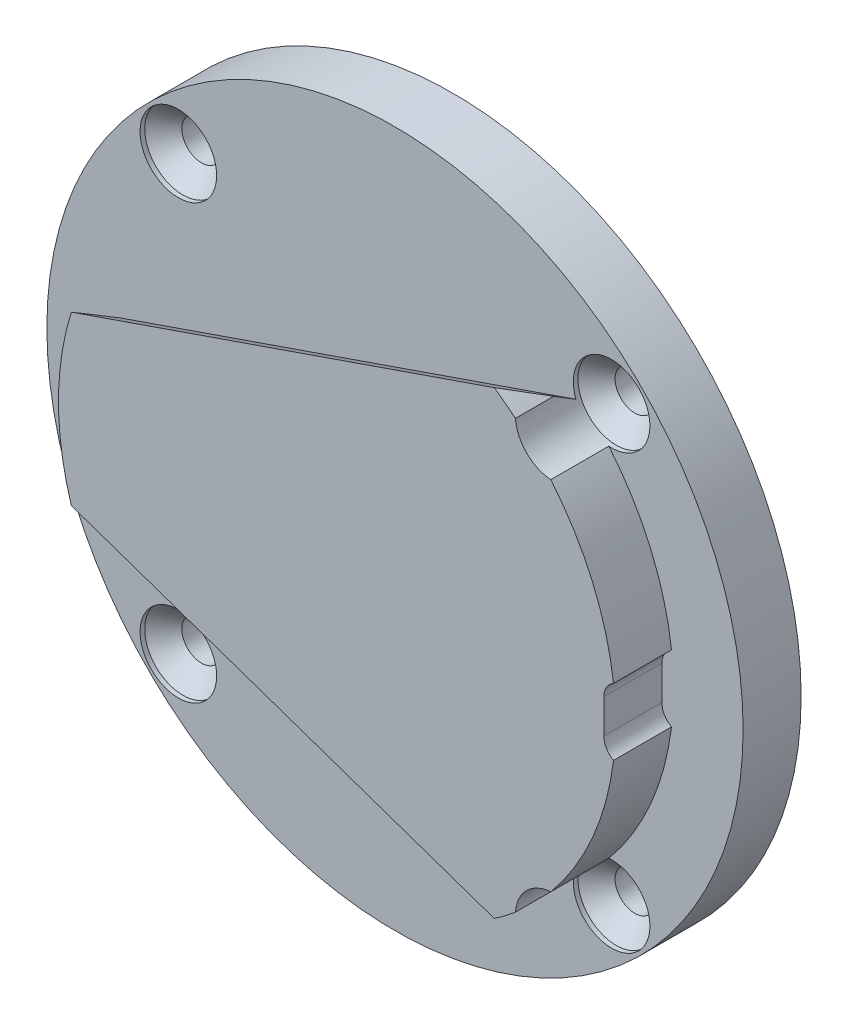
ISO-10303-21;
HEADER;
FILE_DESCRIPTION(('STEP AP214'),'2;1');
FILE_NAME('part.step','',(''),(''),'','','');
FILE_SCHEMA(('AUTOMOTIVE_DESIGN { 1 0 10303 214 1 1 1 1 }'));
ENDSEC;
DATA;
#1=APPLICATION_CONTEXT('core data for automotive mechanical design processes');
#2=APPLICATION_PROTOCOL_DEFINITION('international standard','automotive_design',2000,#1);
#3=PRODUCT_CONTEXT('',#1,'mechanical');
#4=PRODUCT('Part','Part','',(#3));
#5=PRODUCT_RELATED_PRODUCT_CATEGORY('part','',(#4));
#6=PRODUCT_DEFINITION_FORMATION('','',#4);
#7=PRODUCT_DEFINITION_CONTEXT('part definition',#1,'design');
#8=PRODUCT_DEFINITION('design','',#6,#7);
#9=PRODUCT_DEFINITION_SHAPE('','',#8);
#10=(LENGTH_UNIT() NAMED_UNIT(*) SI_UNIT(.MILLI.,.METRE.));
#11=(NAMED_UNIT(*) PLANE_ANGLE_UNIT() SI_UNIT($,.RADIAN.));
#12=(NAMED_UNIT(*) SI_UNIT($,.STERADIAN.) SOLID_ANGLE_UNIT());
#13=UNCERTAINTY_MEASURE_WITH_UNIT(LENGTH_MEASURE(1.E-05),#10,'distance_accuracy_value','');
#14=(GEOMETRIC_REPRESENTATION_CONTEXT(3) GLOBAL_UNCERTAINTY_ASSIGNED_CONTEXT((#13)) GLOBAL_UNIT_ASSIGNED_CONTEXT((#10,
#11,#12)) REPRESENTATION_CONTEXT('',''));
#15=CARTESIAN_POINT('',(0.,0.,0.));
#16=DIRECTION('',(0.,0.,1.));
#17=DIRECTION('',(1.,0.,0.));
#18=AXIS2_PLACEMENT_3D('',#15,#16,#17);
#19=CARTESIAN_POINT('',(0.,0.,12.5));
#20=DIRECTION('',(0.,0.,1.));
#21=DIRECTION('',(-1.,0.,0.));
#22=AXIS2_PLACEMENT_3D('',#19,#20,#21);
#23=CYLINDRICAL_SURFACE('',#22,60.);
#24=CARTESIAN_POINT('',(0.,0.,25.));
#25=DIRECTION('',(0.,0.,1.));
#26=DIRECTION('',(-1.,0.,0.));
#27=AXIS2_PLACEMENT_3D('',#24,#25,#26);
#28=CIRCLE('',#27,60.);
#29=CARTESIAN_POINT('',(59.5692450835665,-7.17670120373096,25.));
#30=VERTEX_POINT('',#29);
#31=CARTESIAN_POINT('',(46.0683596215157,-38.4409448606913,25.));
#32=VERTEX_POINT('',#31);
#33=EDGE_CURVE('E108',#30,#32,#28,.F.);
#34=ORIENTED_EDGE('',*,*,#33,.T.);
#35=DIRECTION('',(0.,0.,-1.));
#36=VECTOR('',#35,1.);
#37=CARTESIAN_POINT('',(46.0683596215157,-38.4409448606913,18.25));
#38=LINE('',#37,#36);
#39=CARTESIAN_POINT('',(46.0683596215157,-38.4409448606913,12.5));
#40=VERTEX_POINT('',#39);
#41=EDGE_CURVE('E9',#32,#40,#38,.T.);
#42=ORIENTED_EDGE('',*,*,#41,.T.);
#43=CARTESIAN_POINT('',(0.,0.,12.5));
#44=DIRECTION('',(0.,0.,1.));
#45=DIRECTION('',(-1.,0.,0.));
#46=AXIS2_PLACEMENT_3D('',#43,#44,#45);
#47=CIRCLE('',#46,60.);
#48=CARTESIAN_POINT('',(59.5692450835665,-7.17670120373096,12.5));
#49=VERTEX_POINT('',#48);
#50=EDGE_CURVE('E196',#40,#49,#47,.T.);
#51=ORIENTED_EDGE('',*,*,#50,.T.);
#52=DIRECTION('',(0.,0.,1.));
#53=VECTOR('',#52,1.);
#54=CARTESIAN_POINT('',(59.5692450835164,-7.17670120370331,-201.753354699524));
#55=LINE('',#54,#53);
#56=EDGE_CURVE('E116',#49,#30,#55,.T.);
#57=ORIENTED_EDGE('',*,*,#56,.T.);
#58=EDGE_LOOP('',(#34,#42,#51,#57));
#59=FACE_BOUND('',#58,.T.);
#60=ADVANCED_FACE('F14',(#59),#23,.T.);
#61=CARTESIAN_POINT('',(0.,0.,-36.9102057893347));
#62=DIRECTION('',(-0.282702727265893,-0.818583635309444,-0.5));
#63=DIRECTION('',(-0.163218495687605,-0.472609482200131,0.866025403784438));
#64=AXIS2_PLACEMENT_3D('',#61,#62,#63);
#65=ELLIPSE('',#64,120.,60.);
#66=CARTESIAN_POINT('',(33.8829537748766,-49.51712273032,25.));
#67=VERTEX_POINT('',#66);
#68=CARTESIAN_POINT('',(38.4409448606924,-46.0683596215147,16.7766848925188));
#69=VERTEX_POINT('',#68);
#70=EDGE_CURVE('E118',#67,#69,#65,.F.);
#71=ORIENTED_EDGE('',*,*,#70,.T.);
#72=DIRECTION('',(0.,0.,-1.));
#73=VECTOR('',#72,1.);
#74=CARTESIAN_POINT('',(38.4409448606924,-46.0683596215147,18.25));
#75=LINE('',#74,#73);
#76=CARTESIAN_POINT('',(38.4409448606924,-46.0683596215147,25.));
#77=VERTEX_POINT('',#76);
#78=EDGE_CURVE('E22',#69,#77,#75,.F.);
#79=ORIENTED_EDGE('',*,*,#78,.T.);
#80=EDGE_CURVE('E111',#77,#67,#28,.F.);
#81=ORIENTED_EDGE('',*,*,#80,.T.);
#82=EDGE_LOOP('',(#71,#79,#81));
#83=FACE_BOUND('',#82,.T.);
#84=ADVANCED_FACE('F141',(#83),#23,.T.);
#85=CARTESIAN_POINT('',(0.,0.,12.5));
#86=DIRECTION('',(0.,0.,1.));
#87=DIRECTION('',(-1.,0.,0.));
#88=AXIS2_PLACEMENT_3D('',#85,#86,#87);
#89=CYLINDRICAL_SURFACE('',#88,60.);
#90=CARTESIAN_POINT('',(0.,0.,25.));
#91=DIRECTION('',(0.,0.,1.));
#92=DIRECTION('',(-1.,0.,0.));
#93=AXIS2_PLACEMENT_3D('',#90,#91,#92);
#94=CIRCLE('',#93,60.);
#95=CARTESIAN_POINT('',(33.8829537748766,49.51712273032,25.));
#96=VERTEX_POINT('',#95);
#97=CARTESIAN_POINT('',(38.4409448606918,46.0683596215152,25.));
#98=VERTEX_POINT('',#97);
#99=EDGE_CURVE('E205',#96,#98,#94,.F.);
#100=ORIENTED_EDGE('',*,*,#99,.T.);
#101=DIRECTION('',(0.,0.,-1.));
#102=VECTOR('',#101,1.);
#103=CARTESIAN_POINT('',(38.4409448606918,46.0683596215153,18.25));
#104=LINE('',#103,#102);
#105=CARTESIAN_POINT('',(38.4409448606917,46.0683596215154,16.7766848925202));
#106=VERTEX_POINT('',#105);
#107=EDGE_CURVE('E180',#98,#106,#104,.T.);
#108=ORIENTED_EDGE('',*,*,#107,.T.);
#109=CARTESIAN_POINT('',(0.,0.,-36.9102057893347));
#110=DIRECTION('',(-0.282702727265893,0.818583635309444,-0.5));
#111=DIRECTION('',(-0.163218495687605,0.472609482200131,0.866025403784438));
#112=AXIS2_PLACEMENT_3D('',#109,#110,#111);
#113=ELLIPSE('',#112,120.,60.);
#114=EDGE_CURVE('E201',#96,#106,#113,.T.);
#115=ORIENTED_EDGE('',*,*,#114,.F.);
#116=EDGE_LOOP('',(#100,#108,#115));
#117=FACE_BOUND('',#116,.T.);
#118=ADVANCED_FACE('F272',(#117),#89,.T.);
#119=CARTESIAN_POINT('',(0.,0.,12.5));
#120=DIRECTION('',(0.,0.,1.));
#121=DIRECTION('',(-1.,0.,0.));
#122=AXIS2_PLACEMENT_3D('',#119,#120,#121);
#123=CIRCLE('',#122,60.);
#124=CARTESIAN_POINT('',(59.5692450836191,7.17670120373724,12.5));
#125=VERTEX_POINT('',#124);
#126=CARTESIAN_POINT('',(46.0683596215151,38.4409448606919,12.5));
#127=VERTEX_POINT('',#126);
#128=EDGE_CURVE('E190',#125,#127,#123,.T.);
#129=ORIENTED_EDGE('',*,*,#128,.T.);
#130=DIRECTION('',(0.,0.,-1.));
#131=VECTOR('',#130,1.);
#132=CARTESIAN_POINT('',(46.0683596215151,38.4409448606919,18.25));
#133=LINE('',#132,#131);
#134=CARTESIAN_POINT('',(46.0683596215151,38.4409448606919,25.));
#135=VERTEX_POINT('',#134);
#136=EDGE_CURVE('E184',#127,#135,#133,.F.);
#137=ORIENTED_EDGE('',*,*,#136,.T.);
#138=CARTESIAN_POINT('',(59.5692450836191,7.17670120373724,25.));
#139=VERTEX_POINT('',#138);
#140=EDGE_CURVE('E239',#135,#139,#94,.F.);
#141=ORIENTED_EDGE('',*,*,#140,.T.);
#142=DIRECTION('',(0.,0.,1.));
#143=VECTOR('',#142,1.);
#144=CARTESIAN_POINT('',(59.5692450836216,7.17670120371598,12.5));
#145=LINE('',#144,#143);
#146=EDGE_CURVE('E202',#139,#125,#145,.F.);
#147=ORIENTED_EDGE('',*,*,#146,.T.);
#148=EDGE_LOOP('',(#129,#137,#141,#147));
#149=FACE_BOUND('',#148,.T.);
#150=ADVANCED_FACE('F256',(#149),#89,.T.);
#151=CARTESIAN_POINT('',(0.,0.,12.5));
#152=DIRECTION('',(0.,0.,-1.));
#153=DIRECTION('',(1.,0.,0.));
#154=AXIS2_PLACEMENT_3D('',#151,#152,#153);
#155=PLANE('',#154);
#156=CARTESIAN_POINT('',(46.6690475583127,-46.6690475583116,12.5));
#157=DIRECTION('',(0.,0.,-1.));
#158=DIRECTION('',(-1.,0.,0.));
#159=AXIS2_PLACEMENT_3D('',#156,#157,#158);
#160=CIRCLE('',#159,8.25);
#161=CARTESIAN_POINT('',(38.9926202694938,-43.6466372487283,12.5));
#162=VERTEX_POINT('',#161);
#163=EDGE_CURVE('E102',#162,#40,#160,.F.);
#164=ORIENTED_EDGE('',*,*,#163,.F.);
#165=DIRECTION('',(0.945218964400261,-0.326436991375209,0.));
#166=VECTOR('',#165,1.);
#167=CARTESIAN_POINT('',(-59.2052404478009,-9.7334219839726,12.5));
#168=LINE('',#167,#166);
#169=CARTESIAN_POINT('',(-59.2052404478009,-9.7334219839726,12.5));
#170=VERTEX_POINT('',#169);
#171=EDGE_CURVE('E149',#170,#162,#168,.T.);
#172=ORIENTED_EDGE('',*,*,#171,.F.);
#173=CARTESIAN_POINT('',(0.,0.,12.5));
#174=DIRECTION('',(0.,0.,1.));
#175=DIRECTION('',(-1.,0.,0.));
#176=AXIS2_PLACEMENT_3D('',#173,#174,#175);
#177=CIRCLE('',#176,60.);
#178=CARTESIAN_POINT('',(-59.2052404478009,9.73342198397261,12.5));
#179=VERTEX_POINT('',#178);
#180=EDGE_CURVE('E189',#179,#170,#177,.T.);
#181=ORIENTED_EDGE('',*,*,#180,.F.);
#182=DIRECTION('',(-0.945218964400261,-0.326436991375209,0.));
#183=VECTOR('',#182,1.);
#184=CARTESIAN_POINT('',(40.5807072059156,44.1950925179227,12.5));
#185=LINE('',#184,#183);
#186=CARTESIAN_POINT('',(38.9926202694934,43.6466372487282,12.5));
#187=VERTEX_POINT('',#186);
#188=EDGE_CURVE('E187',#187,#179,#185,.T.);
#189=ORIENTED_EDGE('',*,*,#188,.F.);
#190=CARTESIAN_POINT('',(46.6690475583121,46.6690475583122,12.5));
#191=DIRECTION('',(0.,0.,-1.));
#192=DIRECTION('',(-1.,0.,0.));
#193=AXIS2_PLACEMENT_3D('',#190,#191,#192);
#194=CIRCLE('',#193,8.25);
#195=EDGE_CURVE('E37',#127,#187,#194,.F.);
#196=ORIENTED_EDGE('',*,*,#195,.F.);
#197=ORIENTED_EDGE('',*,*,#128,.F.);
#198=CARTESIAN_POINT('',(61.4999999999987,3.6735332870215,12.5));
#199=DIRECTION('',(0.,0.,1.));
#200=DIRECTION('',(-1.,0.,0.));
#201=AXIS2_PLACEMENT_3D('',#198,#199,#200);
#202=CIRCLE('',#201,3.99999999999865);
#203=CARTESIAN_POINT('',(57.5,3.6735332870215,12.5));
#204=VERTEX_POINT('',#203);
#205=EDGE_CURVE('E193',#204,#125,#202,.F.);
#206=ORIENTED_EDGE('',*,*,#205,.F.);
#207=DIRECTION('',(0.,-1.,0.));
#208=VECTOR('',#207,1.);
#209=CARTESIAN_POINT('',(57.5,0.,12.5));
#210=LINE('',#209,#208);
#211=CARTESIAN_POINT('',(57.5,-3.6735332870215,12.5));
#212=VERTEX_POINT('',#211);
#213=EDGE_CURVE('E191',#212,#204,#210,.F.);
#214=ORIENTED_EDGE('',*,*,#213,.F.);
#215=CARTESIAN_POINT('',(61.4999999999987,-3.6735332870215,12.5));
#216=DIRECTION('',(0.,0.,1.));
#217=DIRECTION('',(-1.,0.,0.));
#218=AXIS2_PLACEMENT_3D('',#215,#216,#217);
#219=CIRCLE('',#218,3.99999999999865);
#220=EDGE_CURVE('E194',#49,#212,#219,.F.);
#221=ORIENTED_EDGE('',*,*,#220,.F.);
#222=ORIENTED_EDGE('',*,*,#50,.F.);
#223=EDGE_LOOP('',(#164,#172,#181,#189,#196,#197,#206,#214,#221,#222));
#224=FACE_BOUND('',#223,.T.);
#225=CARTESIAN_POINT('',(-46.6690475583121,-46.6690475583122,12.5));
#226=DIRECTION('',(0.,0.,-1.));
#227=DIRECTION('',(-1.,0.,0.));
#228=AXIS2_PLACEMENT_3D('',#225,#226,#227);
#229=CIRCLE('',#228,8.25);
#230=CARTESIAN_POINT('',(-54.9190475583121,-46.6690475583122,12.5));
#231=VERTEX_POINT('',#230);
#232=EDGE_CURVE('E136',#231,#231,#229,.F.);
#233=ORIENTED_EDGE('',*,*,#232,.F.);
#234=EDGE_LOOP('',(#233));
#235=FACE_BOUND('',#234,.T.);
#236=CARTESIAN_POINT('',(-46.6690475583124,46.6690475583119,12.5));
#237=DIRECTION('',(0.,0.,-1.));
#238=DIRECTION('',(-1.,0.,0.));
#239=AXIS2_PLACEMENT_3D('',#236,#237,#238);
#240=CIRCLE('',#239,8.25);
#241=CARTESIAN_POINT('',(-54.9190475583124,46.6690475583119,12.5));
#242=VERTEX_POINT('',#241);
#243=EDGE_CURVE('E131',#242,#242,#240,.F.);
#244=ORIENTED_EDGE('',*,*,#243,.F.);
#245=EDGE_LOOP('',(#244));
#246=FACE_BOUND('',#245,.T.);
#247=CARTESIAN_POINT('',(0.,0.,12.5));
#248=DIRECTION('',(0.,0.,1.));
#249=DIRECTION('',(-1.,0.,0.));
#250=AXIS2_PLACEMENT_3D('',#247,#248,#249);
#251=CIRCLE('',#250,75.);
#252=CARTESIAN_POINT('',(-75.,0.,12.5));
#253=VERTEX_POINT('',#252);
#254=EDGE_CURVE('E221',#253,#253,#251,.F.);
#255=ORIENTED_EDGE('',*,*,#254,.F.);
#256=EDGE_LOOP('',(#255));
#257=FACE_BOUND('',#256,.T.);
#258=ADVANCED_FACE('F261',(#224,#235,#246,#257),#155,.F.);
#259=CARTESIAN_POINT('',(0.,0.,25.));
#260=DIRECTION('',(0.,0.,1.));
#261=DIRECTION('',(-1.,0.,0.));
#262=AXIS2_PLACEMENT_3D('',#259,#260,#261);
#263=PLANE('',#262);
#264=ORIENTED_EDGE('',*,*,#80,.F.);
#265=CARTESIAN_POINT('',(46.6690475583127,-46.6690475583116,25.));
#266=DIRECTION('',(0.,0.,-1.));
#267=DIRECTION('',(0.,1.,0.));
#268=AXIS2_PLACEMENT_3D('',#265,#266,#267);
#269=CIRCLE('',#268,8.25);
#270=EDGE_CURVE('E29',#77,#32,#269,.T.);
#271=ORIENTED_EDGE('',*,*,#270,.T.);
#272=ORIENTED_EDGE('',*,*,#33,.F.);
#273=CARTESIAN_POINT('',(61.4999999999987,-3.6735332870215,25.));
#274=DIRECTION('',(0.,0.,1.));
#275=DIRECTION('',(-1.,0.,0.));
#276=AXIS2_PLACEMENT_3D('',#273,#274,#275);
#277=CIRCLE('',#276,3.99999999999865);
#278=CARTESIAN_POINT('',(57.5,-3.6735332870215,25.));
#279=VERTEX_POINT('',#278);
#280=EDGE_CURVE('E215',#30,#279,#277,.F.);
#281=ORIENTED_EDGE('',*,*,#280,.T.);
#282=DIRECTION('',(0.,1.,0.));
#283=VECTOR('',#282,1.);
#284=CARTESIAN_POINT('',(57.5,3.6735332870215,25.));
#285=LINE('',#284,#283);
#286=CARTESIAN_POINT('',(57.5,3.6735332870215,25.));
#287=VERTEX_POINT('',#286);
#288=EDGE_CURVE('E213',#287,#279,#285,.F.);
#289=ORIENTED_EDGE('',*,*,#288,.F.);
#290=CARTESIAN_POINT('',(61.4999999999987,3.6735332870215,25.));
#291=DIRECTION('',(0.,0.,1.));
#292=DIRECTION('',(-1.,0.,0.));
#293=AXIS2_PLACEMENT_3D('',#290,#291,#292);
#294=CIRCLE('',#293,3.99999999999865);
#295=EDGE_CURVE('E209',#287,#139,#294,.F.);
#296=ORIENTED_EDGE('',*,*,#295,.T.);
#297=ORIENTED_EDGE('',*,*,#140,.F.);
#298=CARTESIAN_POINT('',(46.6690475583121,46.6690475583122,25.));
#299=DIRECTION('',(0.,0.,-1.));
#300=DIRECTION('',(-1.,0.,0.));
#301=AXIS2_PLACEMENT_3D('',#298,#299,#300);
#302=CIRCLE('',#301,8.25);
#303=EDGE_CURVE('E177',#135,#98,#302,.T.);
#304=ORIENTED_EDGE('',*,*,#303,.T.);
#305=ORIENTED_EDGE('',*,*,#99,.F.);
#306=DIRECTION('',(0.945218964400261,0.326436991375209,0.));
#307=VECTOR('',#306,1.);
#308=CARTESIAN_POINT('',(-57.2191991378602,18.0544523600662,25.));
#309=LINE('',#308,#307);
#310=CARTESIAN_POINT('',(-57.2191991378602,18.0544523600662,25.));
#311=VERTEX_POINT('',#310);
#312=EDGE_CURVE('E198',#311,#96,#309,.T.);
#313=ORIENTED_EDGE('',*,*,#312,.F.);
#314=CARTESIAN_POINT('',(0.,0.,25.));
#315=DIRECTION('',(0.,0.,1.));
#316=DIRECTION('',(-1.,0.,0.));
#317=AXIS2_PLACEMENT_3D('',#314,#315,#316);
#318=CIRCLE('',#317,60.);
#319=CARTESIAN_POINT('',(-57.2191991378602,-18.0544523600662,25.));
#320=VERTEX_POINT('',#319);
#321=EDGE_CURVE('E232',#320,#311,#318,.F.);
#322=ORIENTED_EDGE('',*,*,#321,.F.);
#323=DIRECTION('',(-0.945218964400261,0.326436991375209,0.));
#324=VECTOR('',#323,1.);
#325=CARTESIAN_POINT('',(33.8829537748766,-49.51712273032,25.));
#326=LINE('',#325,#324);
#327=EDGE_CURVE('E127',#67,#320,#326,.T.);
#328=ORIENTED_EDGE('',*,*,#327,.F.);
#329=EDGE_LOOP('',(#264,#271,#272,#281,#289,#296,#297,#304,#305,#313,#322,#328));
#330=FACE_BOUND('',#329,.T.);
#331=ADVANCED_FACE('F16',(#330),#263,.T.);
#332=CARTESIAN_POINT('',(33.8829537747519,-49.5171227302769,25.));
#333=DIRECTION('',(-0.282702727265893,-0.818583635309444,-0.5));
#334=DIRECTION('',(0.,-0.521263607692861,0.853395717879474));
#335=AXIS2_PLACEMENT_3D('',#332,#333,#334);
#336=PLANE('',#335);
#337=ORIENTED_EDGE('',*,*,#171,.T.);
#338=CARTESIAN_POINT('',(46.6690475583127,-46.6690475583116,13.1078973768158));
#339=DIRECTION('',(-0.282702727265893,-0.818583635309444,-0.5));
#340=DIRECTION('',(0.163218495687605,0.472609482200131,-0.866025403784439));
#341=AXIS2_PLACEMENT_3D('',#338,#339,#340);
#342=ELLIPSE('',#341,16.5,8.25);
#343=EDGE_CURVE('E112',#162,#69,#342,.F.);
#344=ORIENTED_EDGE('',*,*,#343,.T.);
#345=ORIENTED_EDGE('',*,*,#70,.F.);
#346=ORIENTED_EDGE('',*,*,#327,.T.);
#347=CARTESIAN_POINT('',(0.,0.,-36.9102057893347));
#348=DIRECTION('',(-0.282702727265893,-0.818583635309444,-0.5));
#349=DIRECTION('',(-0.163218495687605,-0.472609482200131,0.866025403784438));
#350=AXIS2_PLACEMENT_3D('',#347,#348,#349);
#351=ELLIPSE('',#350,120.,60.);
#352=EDGE_CURVE('E122',#320,#170,#351,.T.);
#353=ORIENTED_EDGE('',*,*,#352,.T.);
#354=EDGE_LOOP('',(#337,#344,#345,#346,#353));
#355=FACE_BOUND('',#354,.T.);
#356=ADVANCED_FACE('F146',(#355),#336,.T.);
#357=CARTESIAN_POINT('',(61.4999999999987,-3.6735332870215,-201.753354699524));
#358=DIRECTION('',(0.,0.,1.));
#359=DIRECTION('',(-1.,0.,0.));
#360=AXIS2_PLACEMENT_3D('',#357,#358,#359);
#361=CYLINDRICAL_SURFACE('',#360,3.99999999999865);
#362=DIRECTION('',(0.,0.,1.));
#363=VECTOR('',#362,1.);
#364=CARTESIAN_POINT('',(57.5,-3.6735332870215,-201.753354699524));
#365=LINE('',#364,#363);
#366=EDGE_CURVE('E210',#279,#212,#365,.F.);
#367=ORIENTED_EDGE('',*,*,#366,.F.);
#368=ORIENTED_EDGE('',*,*,#280,.F.);
#369=ORIENTED_EDGE('',*,*,#56,.F.);
#370=ORIENTED_EDGE('',*,*,#220,.T.);
#371=EDGE_LOOP('',(#367,#368,#369,#370));
#372=FACE_BOUND('',#371,.T.);
#373=ADVANCED_FACE('F243',(#372),#361,.F.);
#374=CARTESIAN_POINT('',(57.5,3.6735332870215,-201.753354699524));
#375=DIRECTION('',(1.,0.,0.));
#376=DIRECTION('',(0.,1.,0.));
#377=AXIS2_PLACEMENT_3D('',#374,#375,#376);
#378=PLANE('',#377);
#379=ORIENTED_EDGE('',*,*,#288,.T.);
#380=ORIENTED_EDGE('',*,*,#366,.T.);
#381=ORIENTED_EDGE('',*,*,#213,.T.);
#382=DIRECTION('',(0.,0.,1.));
#383=VECTOR('',#382,1.);
#384=CARTESIAN_POINT('',(57.5,3.6735332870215,-201.753354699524));
#385=LINE('',#384,#383);
#386=EDGE_CURVE('E206',#204,#287,#385,.T.);
#387=ORIENTED_EDGE('',*,*,#386,.T.);
#388=EDGE_LOOP('',(#379,#380,#381,#387));
#389=FACE_BOUND('',#388,.T.);
#390=ADVANCED_FACE('F247',(#389),#378,.T.);
#391=CARTESIAN_POINT('',(61.4999999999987,3.6735332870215,-201.753354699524));
#392=DIRECTION('',(0.,0.,1.));
#393=DIRECTION('',(-1.,0.,0.));
#394=AXIS2_PLACEMENT_3D('',#391,#392,#393);
#395=CYLINDRICAL_SURFACE('',#394,3.99999999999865);
#396=ORIENTED_EDGE('',*,*,#146,.F.);
#397=ORIENTED_EDGE('',*,*,#295,.F.);
#398=ORIENTED_EDGE('',*,*,#386,.F.);
#399=ORIENTED_EDGE('',*,*,#205,.T.);
#400=EDGE_LOOP('',(#396,#397,#398,#399));
#401=FACE_BOUND('',#400,.T.);
#402=ADVANCED_FACE('F253',(#401),#395,.F.);
#403=CARTESIAN_POINT('',(33.8829537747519,49.5171227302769,25.));
#404=DIRECTION('',(-0.282702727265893,0.818583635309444,-0.5));
#405=DIRECTION('',(0.,-0.521263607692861,-0.853395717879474));
#406=AXIS2_PLACEMENT_3D('',#403,#404,#405);
#407=PLANE('',#406);
#408=ORIENTED_EDGE('',*,*,#114,.T.);
#409=CARTESIAN_POINT('',(46.6690475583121,46.6690475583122,13.1078973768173));
#410=DIRECTION('',(-0.282702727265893,0.818583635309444,-0.5));
#411=DIRECTION('',(0.163218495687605,-0.472609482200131,-0.866025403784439));
#412=AXIS2_PLACEMENT_3D('',#409,#410,#411);
#413=ELLIPSE('',#412,16.5,8.25);
#414=EDGE_CURVE('E128',#106,#187,#413,.F.);
#415=ORIENTED_EDGE('',*,*,#414,.T.);
#416=ORIENTED_EDGE('',*,*,#188,.T.);
#417=CARTESIAN_POINT('',(0.,0.,-36.9102057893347));
#418=DIRECTION('',(-0.282702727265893,0.818583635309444,-0.5));
#419=DIRECTION('',(-0.163218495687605,0.472609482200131,0.866025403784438));
#420=AXIS2_PLACEMENT_3D('',#417,#418,#419);
#421=ELLIPSE('',#420,120.,60.);
#422=EDGE_CURVE('E197',#311,#179,#421,.F.);
#423=ORIENTED_EDGE('',*,*,#422,.F.);
#424=ORIENTED_EDGE('',*,*,#312,.T.);
#425=EDGE_LOOP('',(#408,#415,#416,#423,#424));
#426=FACE_BOUND('',#425,.T.);
#427=ADVANCED_FACE('F266',(#426),#407,.T.);
#428=CARTESIAN_POINT('',(0.,0.,12.5));
#429=DIRECTION('',(0.,0.,1.));
#430=DIRECTION('',(-1.,0.,0.));
#431=AXIS2_PLACEMENT_3D('',#428,#429,#430);
#432=CYLINDRICAL_SURFACE('',#431,60.);
#433=ORIENTED_EDGE('',*,*,#321,.T.);
#434=ORIENTED_EDGE('',*,*,#422,.T.);
#435=ORIENTED_EDGE('',*,*,#180,.T.);
#436=ORIENTED_EDGE('',*,*,#352,.F.);
#437=EDGE_LOOP('',(#433,#434,#435,#436));
#438=FACE_BOUND('',#437,.T.);
#439=ADVANCED_FACE('F268',(#438),#432,.T.);
#440=CARTESIAN_POINT('',(0.,0.,0.));
#441=DIRECTION('',(0.,0.,1.));
#442=DIRECTION('',(-1.,0.,0.));
#443=AXIS2_PLACEMENT_3D('',#440,#441,#442);
#444=CYLINDRICAL_SURFACE('',#443,75.);
#445=ORIENTED_EDGE('',*,*,#254,.T.);
#446=EDGE_LOOP('',(#445));
#447=FACE_BOUND('',#446,.T.);
#448=CARTESIAN_POINT('',(0.,0.,0.));
#449=DIRECTION('',(0.,0.,1.));
#450=DIRECTION('',(-1.,0.,0.));
#451=AXIS2_PLACEMENT_3D('',#448,#449,#450);
#452=CIRCLE('',#451,75.);
#453=CARTESIAN_POINT('',(-75.,0.,0.));
#454=VERTEX_POINT('',#453);
#455=EDGE_CURVE('E130',#454,#454,#452,.F.);
#456=ORIENTED_EDGE('',*,*,#455,.F.);
#457=EDGE_LOOP('',(#456));
#458=FACE_BOUND('',#457,.T.);
#459=ADVANCED_FACE('F314',(#447,#458),#444,.T.);
#460=CARTESIAN_POINT('',(0.,0.,0.));
#461=DIRECTION('',(0.,0.,-1.));
#462=DIRECTION('',(1.,0.,0.));
#463=AXIS2_PLACEMENT_3D('',#460,#461,#462);
#464=PLANE('',#463);
#465=CARTESIAN_POINT('',(46.6690475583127,-46.6690475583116,0.));
#466=DIRECTION('',(0.,0.,-1.));
#467=DIRECTION('',(0.,1.,0.));
#468=AXIS2_PLACEMENT_3D('',#465,#466,#467);
#469=CIRCLE('',#468,4.25);
#470=CARTESIAN_POINT('',(46.6690475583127,-42.4190475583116,0.));
#471=VERTEX_POINT('',#470);
#472=EDGE_CURVE('E497',#471,#471,#469,.T.);
#473=ORIENTED_EDGE('',*,*,#472,.F.);
#474=EDGE_LOOP('',(#473));
#475=FACE_BOUND('',#474,.T.);
#476=CARTESIAN_POINT('',(-46.6690475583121,-46.6690475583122,0.));
#477=DIRECTION('',(0.,0.,-1.));
#478=DIRECTION('',(1.,0.,0.));
#479=AXIS2_PLACEMENT_3D('',#476,#477,#478);
#480=CIRCLE('',#479,4.25);
#481=CARTESIAN_POINT('',(-42.4190475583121,-46.6690475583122,0.));
#482=VERTEX_POINT('',#481);
#483=EDGE_CURVE('E151',#482,#482,#480,.T.);
#484=ORIENTED_EDGE('',*,*,#483,.F.);
#485=EDGE_LOOP('',(#484));
#486=FACE_BOUND('',#485,.T.);
#487=CARTESIAN_POINT('',(-46.6690475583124,46.6690475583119,0.));
#488=DIRECTION('',(0.,0.,-1.));
#489=DIRECTION('',(0.,-1.,0.));
#490=AXIS2_PLACEMENT_3D('',#487,#488,#489);
#491=CIRCLE('',#490,4.25);
#492=CARTESIAN_POINT('',(-46.6690475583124,42.4190475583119,0.));
#493=VERTEX_POINT('',#492);
#494=EDGE_CURVE('E138',#493,#493,#491,.T.);
#495=ORIENTED_EDGE('',*,*,#494,.F.);
#496=EDGE_LOOP('',(#495));
#497=FACE_BOUND('',#496,.T.);
#498=CARTESIAN_POINT('',(46.6690475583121,46.6690475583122,0.));
#499=DIRECTION('',(0.,0.,-1.));
#500=DIRECTION('',(-1.,0.,0.));
#501=AXIS2_PLACEMENT_3D('',#498,#499,#500);
#502=CIRCLE('',#501,4.25);
#503=CARTESIAN_POINT('',(42.4190475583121,46.6690475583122,0.));
#504=VERTEX_POINT('',#503);
#505=EDGE_CURVE('E134',#504,#504,#502,.T.);
#506=ORIENTED_EDGE('',*,*,#505,.F.);
#507=EDGE_LOOP('',(#506));
#508=FACE_BOUND('',#507,.T.);
#509=ORIENTED_EDGE('',*,*,#455,.T.);
#510=EDGE_LOOP('',(#509));
#511=FACE_BOUND('',#510,.T.);
#512=ADVANCED_FACE('F301',(#475,#486,#497,#508,#511),#464,.T.);
#513=CARTESIAN_POINT('',(46.6690475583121,46.6690475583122,0.));
#514=DIRECTION('',(0.,0.,-1.));
#515=DIRECTION('',(-1.,0.,0.));
#516=AXIS2_PLACEMENT_3D('',#513,#514,#515);
#517=CYLINDRICAL_SURFACE('',#516,8.25);
#518=CARTESIAN_POINT('',(46.6690475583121,46.6690475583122,11.5));
#519=DIRECTION('',(0.,0.,-1.));
#520=DIRECTION('',(-1.,0.,0.));
#521=AXIS2_PLACEMENT_3D('',#518,#519,#520);
#522=CIRCLE('',#521,8.25);
#523=CARTESIAN_POINT('',(38.4190475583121,46.6690475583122,11.5));
#524=VERTEX_POINT('',#523);
#525=EDGE_CURVE('E174',#524,#524,#522,.T.);
#526=ORIENTED_EDGE('',*,*,#525,.T.);
#527=EDGE_LOOP('',(#526));
#528=FACE_BOUND('',#527,.T.);
#529=ORIENTED_EDGE('',*,*,#195,.T.);
#530=ORIENTED_EDGE('',*,*,#414,.F.);
#531=ORIENTED_EDGE('',*,*,#107,.F.);
#532=ORIENTED_EDGE('',*,*,#303,.F.);
#533=ORIENTED_EDGE('',*,*,#136,.F.);
#534=EDGE_LOOP('',(#529,#530,#531,#532,#533));
#535=FACE_BOUND('',#534,.T.);
#536=ADVANCED_FACE('F258',(#528,#535),#517,.F.);
#537=CARTESIAN_POINT('',(46.6690475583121,46.6690475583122,11.5));
#538=DIRECTION('',(0.,0.,1.));
#539=DIRECTION('',(1.,0.,0.));
#540=AXIS2_PLACEMENT_3D('',#537,#538,#539);
#541=CONICAL_SURFACE('',#540,8.25,0.78539816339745);
#542=CARTESIAN_POINT('',(46.6690475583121,46.6690475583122,7.5));
#543=DIRECTION('',(0.,0.,-1.));
#544=DIRECTION('',(-1.,0.,0.));
#545=AXIS2_PLACEMENT_3D('',#542,#543,#544);
#546=CIRCLE('',#545,4.25);
#547=CARTESIAN_POINT('',(42.4190475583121,46.6690475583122,7.5));
#548=VERTEX_POINT('',#547);
#549=EDGE_CURVE('E171',#548,#548,#546,.T.);
#550=ORIENTED_EDGE('',*,*,#549,.T.);
#551=EDGE_LOOP('',(#550));
#552=FACE_BOUND('',#551,.T.);
#553=ORIENTED_EDGE('',*,*,#525,.F.);
#554=EDGE_LOOP('',(#553));
#555=FACE_BOUND('',#554,.T.);
#556=ADVANCED_FACE('F303',(#552,#555),#541,.F.);
#557=CARTESIAN_POINT('',(46.6690475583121,46.6690475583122,0.));
#558=DIRECTION('',(0.,0.,-1.));
#559=DIRECTION('',(-1.,0.,0.));
#560=AXIS2_PLACEMENT_3D('',#557,#558,#559);
#561=CYLINDRICAL_SURFACE('',#560,4.25);
#562=ORIENTED_EDGE('',*,*,#505,.T.);
#563=EDGE_LOOP('',(#562));
#564=FACE_BOUND('',#563,.T.);
#565=ORIENTED_EDGE('',*,*,#549,.F.);
#566=EDGE_LOOP('',(#565));
#567=FACE_BOUND('',#566,.T.);
#568=ADVANCED_FACE('F311',(#564,#567),#561,.F.);
#569=CARTESIAN_POINT('',(-46.6690475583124,46.6690475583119,0.));
#570=DIRECTION('',(0.,0.,-1.));
#571=DIRECTION('',(0.,-1.,0.));
#572=AXIS2_PLACEMENT_3D('',#569,#570,#571);
#573=CYLINDRICAL_SURFACE('',#572,8.25);
#574=CARTESIAN_POINT('',(-46.6690475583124,46.6690475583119,11.5));
#575=DIRECTION('',(0.,0.,-1.));
#576=DIRECTION('',(0.,-1.,0.));
#577=AXIS2_PLACEMENT_3D('',#574,#575,#576);
#578=CIRCLE('',#577,8.25);
#579=CARTESIAN_POINT('',(-46.6690475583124,38.4190475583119,11.5));
#580=VERTEX_POINT('',#579);
#581=EDGE_CURVE('E135',#580,#580,#578,.T.);
#582=ORIENTED_EDGE('',*,*,#581,.T.);
#583=EDGE_LOOP('',(#582));
#584=FACE_BOUND('',#583,.T.);
#585=ORIENTED_EDGE('',*,*,#243,.T.);
#586=EDGE_LOOP('',(#585));
#587=FACE_BOUND('',#586,.T.);
#588=ADVANCED_FACE('F403',(#584,#587),#573,.F.);
#589=CARTESIAN_POINT('',(-46.6690475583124,46.6690475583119,11.5));
#590=DIRECTION('',(0.,0.,1.));
#591=DIRECTION('',(0.,1.,0.));
#592=AXIS2_PLACEMENT_3D('',#589,#590,#591);
#593=CONICAL_SURFACE('',#592,8.25,0.78539816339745);
#594=CARTESIAN_POINT('',(-46.6690475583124,46.6690475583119,7.5));
#595=DIRECTION('',(0.,0.,-1.));
#596=DIRECTION('',(0.,-1.,0.));
#597=AXIS2_PLACEMENT_3D('',#594,#595,#596);
#598=CIRCLE('',#597,4.25);
#599=CARTESIAN_POINT('',(-46.6690475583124,42.4190475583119,7.5));
#600=VERTEX_POINT('',#599);
#601=EDGE_CURVE('E164',#600,#600,#598,.T.);
#602=ORIENTED_EDGE('',*,*,#601,.T.);
#603=EDGE_LOOP('',(#602));
#604=FACE_BOUND('',#603,.T.);
#605=ORIENTED_EDGE('',*,*,#581,.F.);
#606=EDGE_LOOP('',(#605));
#607=FACE_BOUND('',#606,.T.);
#608=ADVANCED_FACE('F410',(#604,#607),#593,.F.);
#609=CARTESIAN_POINT('',(-46.6690475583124,46.6690475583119,0.));
#610=DIRECTION('',(0.,0.,-1.));
#611=DIRECTION('',(0.,-1.,0.));
#612=AXIS2_PLACEMENT_3D('',#609,#610,#611);
#613=CYLINDRICAL_SURFACE('',#612,4.25);
#614=ORIENTED_EDGE('',*,*,#494,.T.);
#615=EDGE_LOOP('',(#614));
#616=FACE_BOUND('',#615,.T.);
#617=ORIENTED_EDGE('',*,*,#601,.F.);
#618=EDGE_LOOP('',(#617));
#619=FACE_BOUND('',#618,.T.);
#620=ADVANCED_FACE('F419',(#616,#619),#613,.F.);
#621=CARTESIAN_POINT('',(-46.6690475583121,-46.6690475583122,0.));
#622=DIRECTION('',(0.,0.,-1.));
#623=DIRECTION('',(1.,0.,0.));
#624=AXIS2_PLACEMENT_3D('',#621,#622,#623);
#625=CYLINDRICAL_SURFACE('',#624,8.25);
#626=CARTESIAN_POINT('',(-46.6690475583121,-46.6690475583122,11.5));
#627=DIRECTION('',(0.,0.,-1.));
#628=DIRECTION('',(1.,0.,0.));
#629=AXIS2_PLACEMENT_3D('',#626,#627,#628);
#630=CIRCLE('',#629,8.25);
#631=CARTESIAN_POINT('',(-38.4190475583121,-46.6690475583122,11.5));
#632=VERTEX_POINT('',#631);
#633=EDGE_CURVE('E139',#632,#632,#630,.T.);
#634=ORIENTED_EDGE('',*,*,#633,.T.);
#635=EDGE_LOOP('',(#634));
#636=FACE_BOUND('',#635,.T.);
#637=ORIENTED_EDGE('',*,*,#232,.T.);
#638=EDGE_LOOP('',(#637));
#639=FACE_BOUND('',#638,.T.);
#640=ADVANCED_FACE('F428',(#636,#639),#625,.F.);
#641=CARTESIAN_POINT('',(-46.6690475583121,-46.6690475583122,11.5));
#642=DIRECTION('',(0.,0.,1.));
#643=DIRECTION('',(-1.,0.,0.));
#644=AXIS2_PLACEMENT_3D('',#641,#642,#643);
#645=CONICAL_SURFACE('',#644,8.25,0.78539816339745);
#646=CARTESIAN_POINT('',(-46.6690475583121,-46.6690475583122,7.5));
#647=DIRECTION('',(0.,0.,-1.));
#648=DIRECTION('',(1.,0.,0.));
#649=AXIS2_PLACEMENT_3D('',#646,#647,#648);
#650=CIRCLE('',#649,4.25);
#651=CARTESIAN_POINT('',(-42.4190475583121,-46.6690475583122,7.5));
#652=VERTEX_POINT('',#651);
#653=EDGE_CURVE('E157',#652,#652,#650,.T.);
#654=ORIENTED_EDGE('',*,*,#653,.T.);
#655=EDGE_LOOP('',(#654));
#656=FACE_BOUND('',#655,.T.);
#657=ORIENTED_EDGE('',*,*,#633,.F.);
#658=EDGE_LOOP('',(#657));
#659=FACE_BOUND('',#658,.T.);
#660=ADVANCED_FACE('F437',(#656,#659),#645,.F.);
#661=CARTESIAN_POINT('',(-46.6690475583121,-46.6690475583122,0.));
#662=DIRECTION('',(0.,0.,-1.));
#663=DIRECTION('',(1.,0.,0.));
#664=AXIS2_PLACEMENT_3D('',#661,#662,#663);
#665=CYLINDRICAL_SURFACE('',#664,4.25);
#666=ORIENTED_EDGE('',*,*,#483,.T.);
#667=EDGE_LOOP('',(#666));
#668=FACE_BOUND('',#667,.T.);
#669=ORIENTED_EDGE('',*,*,#653,.F.);
#670=EDGE_LOOP('',(#669));
#671=FACE_BOUND('',#670,.T.);
#672=ADVANCED_FACE('F446',(#668,#671),#665,.F.);
#673=CARTESIAN_POINT('',(46.6690475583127,-46.6690475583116,0.));
#674=DIRECTION('',(0.,0.,-1.));
#675=DIRECTION('',(0.,1.,0.));
#676=AXIS2_PLACEMENT_3D('',#673,#674,#675);
#677=CYLINDRICAL_SURFACE('',#676,8.25);
#678=CARTESIAN_POINT('',(46.6690475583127,-46.6690475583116,11.5));
#679=DIRECTION('',(0.,0.,-1.));
#680=DIRECTION('',(0.,1.,0.));
#681=AXIS2_PLACEMENT_3D('',#678,#679,#680);
#682=CIRCLE('',#681,8.25);
#683=CARTESIAN_POINT('',(46.6690475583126,-38.4190475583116,11.5));
#684=VERTEX_POINT('',#683);
#685=EDGE_CURVE('E113',#684,#684,#682,.T.);
#686=ORIENTED_EDGE('',*,*,#685,.T.);
#687=EDGE_LOOP('',(#686));
#688=FACE_BOUND('',#687,.T.);
#689=ORIENTED_EDGE('',*,*,#270,.F.);
#690=ORIENTED_EDGE('',*,*,#78,.F.);
#691=ORIENTED_EDGE('',*,*,#343,.F.);
#692=ORIENTED_EDGE('',*,*,#163,.T.);
#693=ORIENTED_EDGE('',*,*,#41,.F.);
#694=EDGE_LOOP('',(#689,#690,#691,#692,#693));
#695=FACE_BOUND('',#694,.T.);
#696=ADVANCED_FACE('F100',(#688,#695),#677,.F.);
#697=CARTESIAN_POINT('',(46.6690475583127,-46.6690475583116,11.5));
#698=DIRECTION('',(0.,0.,1.));
#699=DIRECTION('',(0.,-1.,0.));
#700=AXIS2_PLACEMENT_3D('',#697,#698,#699);
#701=CONICAL_SURFACE('',#700,8.25,0.78539816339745);
#702=CARTESIAN_POINT('',(46.6690475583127,-46.6690475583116,7.5));
#703=DIRECTION('',(0.,0.,-1.));
#704=DIRECTION('',(0.,1.,0.));
#705=AXIS2_PLACEMENT_3D('',#702,#703,#704);
#706=CIRCLE('',#705,4.25);
#707=CARTESIAN_POINT('',(46.6690475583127,-42.4190475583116,7.5));
#708=VERTEX_POINT('',#707);
#709=EDGE_CURVE('E500',#708,#708,#706,.T.);
#710=ORIENTED_EDGE('',*,*,#709,.T.);
#711=EDGE_LOOP('',(#710));
#712=FACE_BOUND('',#711,.T.);
#713=ORIENTED_EDGE('',*,*,#685,.F.);
#714=EDGE_LOOP('',(#713));
#715=FACE_BOUND('',#714,.T.);
#716=ADVANCED_FACE('F463',(#712,#715),#701,.F.);
#717=CARTESIAN_POINT('',(46.6690475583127,-46.6690475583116,0.));
#718=DIRECTION('',(0.,0.,-1.));
#719=DIRECTION('',(0.,1.,0.));
#720=AXIS2_PLACEMENT_3D('',#717,#718,#719);
#721=CYLINDRICAL_SURFACE('',#720,4.25);
#722=ORIENTED_EDGE('',*,*,#472,.T.);
#723=EDGE_LOOP('',(#722));
#724=FACE_BOUND('',#723,.T.);
#725=ORIENTED_EDGE('',*,*,#709,.F.);
#726=EDGE_LOOP('',(#725));
#727=FACE_BOUND('',#726,.T.);
#728=ADVANCED_FACE('F472',(#724,#727),#721,.F.);
#729=CLOSED_SHELL('',(#60,#84,#118,#150,#258,#331,#356,#373,#390,#402,#427,#439,#459,#512,#536,
#556,#568,#588,#608,#620,#640,#660,#672,#696,#716,#728));
#730=MANIFOLD_SOLID_BREP('B1',#729);
#731=ADVANCED_BREP_SHAPE_REPRESENTATION('',(#18,#730),#14);
#732=SHAPE_DEFINITION_REPRESENTATION(#9,#731);
ENDSEC;
END-ISO-10303-21;
